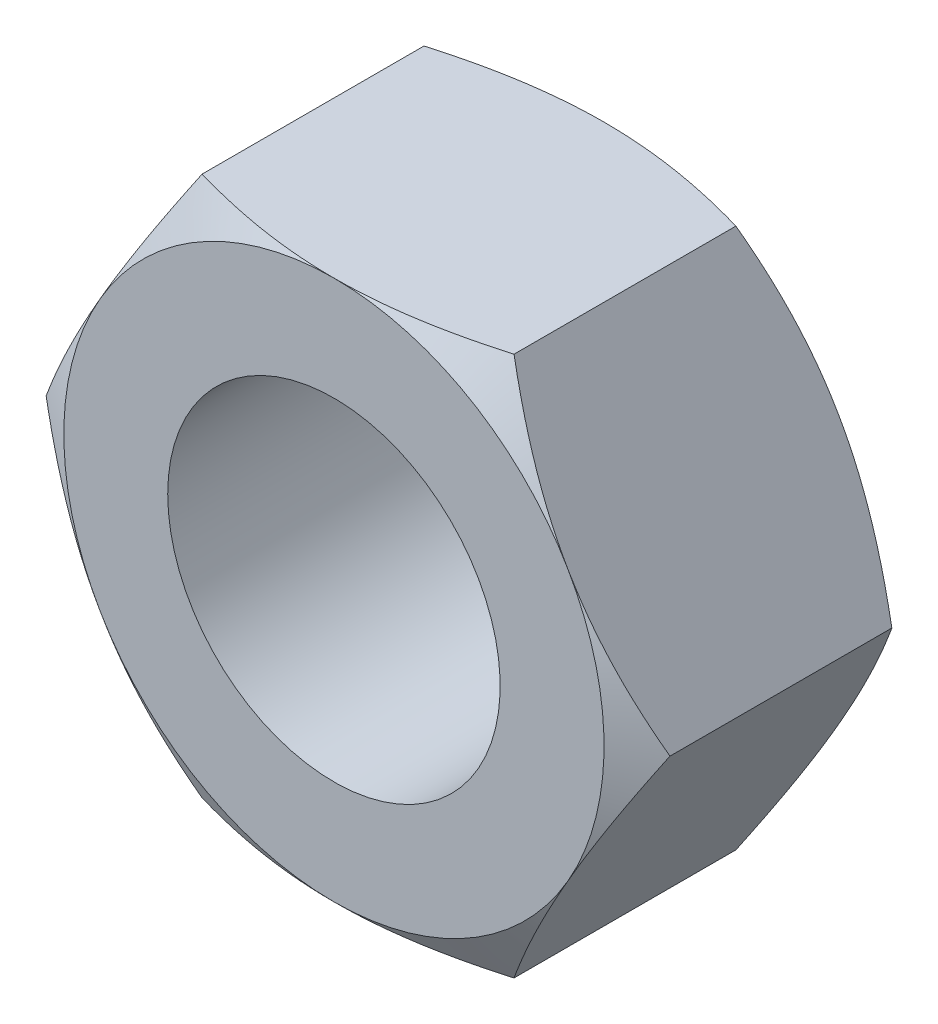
ISO-10303-21;
HEADER;
FILE_DESCRIPTION(('STEP AP214'),'2;1');
FILE_NAME('part.step','',(''),(''),'','','');
FILE_SCHEMA(('AUTOMOTIVE_DESIGN { 1 0 10303 214 1 1 1 1 }'));
ENDSEC;
DATA;
#1=APPLICATION_CONTEXT('core data for automotive mechanical design processes');
#2=APPLICATION_PROTOCOL_DEFINITION('international standard','automotive_design',2000,#1);
#3=PRODUCT_CONTEXT('',#1,'mechanical');
#4=PRODUCT('Part','Part','',(#3));
#5=PRODUCT_RELATED_PRODUCT_CATEGORY('part','',(#4));
#6=PRODUCT_DEFINITION_FORMATION('','',#4);
#7=PRODUCT_DEFINITION_CONTEXT('part definition',#1,'design');
#8=PRODUCT_DEFINITION('design','',#6,#7);
#9=PRODUCT_DEFINITION_SHAPE('','',#8);
#10=(LENGTH_UNIT() NAMED_UNIT(*) SI_UNIT(.MILLI.,.METRE.));
#11=(NAMED_UNIT(*) PLANE_ANGLE_UNIT() SI_UNIT($,.RADIAN.));
#12=(NAMED_UNIT(*) SI_UNIT($,.STERADIAN.) SOLID_ANGLE_UNIT());
#13=UNCERTAINTY_MEASURE_WITH_UNIT(LENGTH_MEASURE(1.E-05),#10,'distance_accuracy_value','');
#14=(GEOMETRIC_REPRESENTATION_CONTEXT(3) GLOBAL_UNCERTAINTY_ASSIGNED_CONTEXT((#13)) GLOBAL_UNIT_ASSIGNED_CONTEXT((#10,
#11,#12)) REPRESENTATION_CONTEXT('',''));
#15=CARTESIAN_POINT('',(0.,0.,0.));
#16=DIRECTION('',(0.,0.,1.));
#17=DIRECTION('',(1.,0.,0.));
#18=AXIS2_PLACEMENT_3D('',#15,#16,#17);
#19=CARTESIAN_POINT('',(-7.5055534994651,0.,3.25));
#20=DIRECTION('',(-0.866025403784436,0.500000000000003,0.));
#21=DIRECTION('',(-0.500000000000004,-0.866025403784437,0.));
#22=AXIS2_PLACEMENT_3D('',#19,#20,#21);
#23=PLANE('',#22);
#24=DIRECTION('',(0.,0.,-1.));
#25=VECTOR('',#24,1.);
#26=CARTESIAN_POINT('',(-7.5055534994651,0.,3.25));
#27=LINE('',#26,#25);
#28=CARTESIAN_POINT('',(-7.50555349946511,0.,2.66944341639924));
#29=VERTEX_POINT('',#28);
#30=CARTESIAN_POINT('',(-7.50555349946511,0.,-2.66944341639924));
#31=VERTEX_POINT('',#30);
#32=EDGE_CURVE('E137',#29,#31,#27,.T.);
#33=ORIENTED_EDGE('',*,*,#32,.F.);
#34=CARTESIAN_POINT('',(-7.50566896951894,-0.00019999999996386,2.66937674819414));
#35=CARTESIAN_POINT('',(-7.42317863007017,0.142677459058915,2.71699557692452));
#36=CARTESIAN_POINT('',(-7.34038072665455,0.286087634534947,2.7624532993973));
#37=CARTESIAN_POINT('',(-7.17411251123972,0.574072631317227,2.84845131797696));
#38=CARTESIAN_POINT('',(-7.09064192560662,0.718647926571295,2.88898949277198));
#39=CARTESIAN_POINT('',(-6.83889369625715,1.15468865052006,3.00242899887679));
#40=CARTESIAN_POINT('',(-6.66962231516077,1.44787528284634,3.06695219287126));
#41=CARTESIAN_POINT('',(-6.41631077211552,1.8866237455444,3.14261341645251));
#42=CARTESIAN_POINT('',(-6.33302748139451,2.03087463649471,3.16416714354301));
#43=CARTESIAN_POINT('',(-6.1660845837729,2.32002821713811,3.20030968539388));
#44=CARTESIAN_POINT('',(-6.0824250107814,2.46493084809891,3.21489911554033));
#45=CARTESIAN_POINT('',(-5.91496056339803,2.75498777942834,3.23674124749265));
#46=CARTESIAN_POINT('',(-5.83115596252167,2.90014160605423,3.24400227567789));
#47=CARTESIAN_POINT('',(-5.66347396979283,3.19057533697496,3.25103969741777));
#48=CARTESIAN_POINT('',(-5.57959658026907,3.33585523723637,3.25081632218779));
#49=CARTESIAN_POINT('',(-5.3497992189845,3.7338759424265,3.23991654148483));
#50=CARTESIAN_POINT('',(-5.20395446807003,3.98648646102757,3.22161818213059));
#51=CARTESIAN_POINT('',(-4.91323365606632,4.49002967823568,3.16359365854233));
#52=CARTESIAN_POINT('',(-4.76835861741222,4.74096060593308,3.12384766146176));
#53=CARTESIAN_POINT('',(-4.47705272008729,5.24551722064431,3.02449409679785));
#54=CARTESIAN_POINT('',(-4.330658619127,5.4990792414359,2.96446557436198));
#55=CARTESIAN_POINT('',(-4.04005357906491,6.00242193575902,2.82822500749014));
#56=CARTESIAN_POINT('',(-3.89583891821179,6.25220905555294,2.75204496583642));
#57=CARTESIAN_POINT('',(-3.7526612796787,6.50019999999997,2.66937674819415));
#58=B_SPLINE_CURVE_WITH_KNOTS('',3,(#34,#35,#36,#37,#38,#39,#40,#41,#42,#43,#44,#45,#46,#47,#48,
#49,#50,#51,#52,#53,#54,#55,#56,#57),.UNSPECIFIED.,.F.,.F.,(4,2,2,2,2,2,2,2,2,2,2,4),(0.,
0.515105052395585,1.03043143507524,2.06322554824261,2.56697389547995,3.07067772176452,
3.57380860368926,4.07692394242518,4.95279354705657,5.82947446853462,6.72559912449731,
7.6199645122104),.UNSPECIFIED.);
#59=CARTESIAN_POINT('',(-5.62916512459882,3.25000000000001,3.25));
#60=VERTEX_POINT('',#59);
#61=EDGE_CURVE('E121',#29,#60,#58,.T.);
#62=ORIENTED_EDGE('',*,*,#61,.T.);
#63=CARTESIAN_POINT('',(-3.75277674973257,6.49999999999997,2.66944341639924));
#64=VERTEX_POINT('',#63);
#65=EDGE_CURVE('E130',#60,#64,#58,.T.);
#66=ORIENTED_EDGE('',*,*,#65,.T.);
#67=DIRECTION('',(0.,0.,-1.));
#68=VECTOR('',#67,1.);
#69=CARTESIAN_POINT('',(-3.75277674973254,6.49999999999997,3.25));
#70=LINE('',#69,#68);
#71=CARTESIAN_POINT('',(-3.75277674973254,6.49999999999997,-2.66944341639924));
#72=VERTEX_POINT('',#71);
#73=EDGE_CURVE('E163',#64,#72,#70,.T.);
#74=ORIENTED_EDGE('',*,*,#73,.T.);
#75=CARTESIAN_POINT('',(-3.7526612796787,6.50019999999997,-2.66937674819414));
#76=CARTESIAN_POINT('',(-3.83515161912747,6.35732254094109,-2.71699557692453));
#77=CARTESIAN_POINT('',(-3.91794952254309,6.21391236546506,-2.7624532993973));
#78=CARTESIAN_POINT('',(-4.08421773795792,5.92592736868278,-2.84845131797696));
#79=CARTESIAN_POINT('',(-4.16768832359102,5.78135207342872,-2.88898949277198));
#80=CARTESIAN_POINT('',(-4.41943655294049,5.34531134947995,-3.0024289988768));
#81=CARTESIAN_POINT('',(-4.58870793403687,5.05212471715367,-3.06695219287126));
#82=CARTESIAN_POINT('',(-4.84201947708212,4.61337625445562,-3.14261341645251));
#83=CARTESIAN_POINT('',(-4.92530276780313,4.4691253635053,-3.16416714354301));
#84=CARTESIAN_POINT('',(-5.09224566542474,4.1799717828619,-3.20030968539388));
#85=CARTESIAN_POINT('',(-5.17590523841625,4.0350691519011,-3.21489911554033));
#86=CARTESIAN_POINT('',(-5.34336968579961,3.74501222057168,-3.23674124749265));
#87=CARTESIAN_POINT('',(-5.42717428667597,3.59985839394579,-3.24400227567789));
#88=CARTESIAN_POINT('',(-5.59485627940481,3.30942466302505,-3.25103969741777));
#89=CARTESIAN_POINT('',(-5.67873366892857,3.16414476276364,-3.25081632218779));
#90=CARTESIAN_POINT('',(-5.90853103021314,2.76612405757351,-3.23991654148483));
#91=CARTESIAN_POINT('',(-6.05437578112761,2.51351353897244,-3.22161818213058));
#92=CARTESIAN_POINT('',(-6.34509659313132,2.00997032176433,-3.16359365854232));
#93=CARTESIAN_POINT('',(-6.48997163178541,1.75903939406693,-3.12384766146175));
#94=CARTESIAN_POINT('',(-6.78127752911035,1.2544827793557,-3.02449409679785));
#95=CARTESIAN_POINT('',(-6.92767163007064,1.00092075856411,-2.96446557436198));
#96=CARTESIAN_POINT('',(-7.21827667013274,0.497578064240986,-2.82822500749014));
#97=CARTESIAN_POINT('',(-7.36249133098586,0.247790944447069,-2.75204496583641));
#98=CARTESIAN_POINT('',(-7.50566896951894,-0.000199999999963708,-2.66937674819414));
#99=B_SPLINE_CURVE_WITH_KNOTS('',3,(#75,#76,#77,#78,#79,#80,#81,#82,#83,#84,#85,#86,#87,#88,#89,
#90,#91,#92,#93,#94,#95,#96,#97,#98),.UNSPECIFIED.,.F.,.F.,(4,2,2,2,2,2,2,2,2,2,2,4),(0.,
0.515105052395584,1.03043143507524,2.06322554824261,2.56697389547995,3.07067772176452,
3.57380860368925,4.07692394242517,4.95279354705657,5.82947446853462,6.72559912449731,
7.6199645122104),.UNSPECIFIED.);
#100=CARTESIAN_POINT('',(-5.62916512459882,3.25000000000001,-3.25));
#101=VERTEX_POINT('',#100);
#102=EDGE_CURVE('E171',#72,#101,#99,.T.);
#103=ORIENTED_EDGE('',*,*,#102,.T.);
#104=EDGE_CURVE('E145',#101,#31,#99,.T.);
#105=ORIENTED_EDGE('',*,*,#104,.T.);
#106=EDGE_LOOP('',(#33,#62,#66,#74,#103,#105));
#107=FACE_BOUND('',#106,.T.);
#108=ADVANCED_FACE('F30',(#107),#23,.T.);
#109=CARTESIAN_POINT('',(-3.75277674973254,-6.49999999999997,3.25));
#110=DIRECTION('',(-0.866025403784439,-0.499999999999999,0.));
#111=DIRECTION('',(0.499999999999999,-0.866025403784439,0.));
#112=AXIS2_PLACEMENT_3D('',#109,#110,#111);
#113=PLANE('',#112);
#114=DIRECTION('',(0.,0.,-1.));
#115=VECTOR('',#114,1.);
#116=CARTESIAN_POINT('',(-3.75277674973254,-6.49999999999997,3.25));
#117=LINE('',#116,#115);
#118=CARTESIAN_POINT('',(-3.75277674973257,-6.49999999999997,2.66944341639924));
#119=VERTEX_POINT('',#118);
#120=CARTESIAN_POINT('',(-3.75277674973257,-6.49999999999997,-2.66944341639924));
#121=VERTEX_POINT('',#120);
#122=EDGE_CURVE('E147',#119,#121,#117,.T.);
#123=ORIENTED_EDGE('',*,*,#122,.F.);
#124=CARTESIAN_POINT('',(-3.75266127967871,-6.50019999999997,2.66937674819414));
#125=CARTESIAN_POINT('',(-3.83515161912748,-6.3573225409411,2.71699557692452));
#126=CARTESIAN_POINT('',(-3.9179495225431,-6.21391236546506,2.7624532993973));
#127=CARTESIAN_POINT('',(-4.08421773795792,-5.92592736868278,2.84845131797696));
#128=CARTESIAN_POINT('',(-4.16768832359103,-5.78135207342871,2.88898949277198));
#129=CARTESIAN_POINT('',(-4.41943655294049,-5.34531134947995,3.0024289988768));
#130=CARTESIAN_POINT('',(-4.58870793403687,-5.05212471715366,3.06695219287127));
#131=CARTESIAN_POINT('',(-4.84201947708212,-4.61337625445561,3.14261341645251));
#132=CARTESIAN_POINT('',(-4.92530276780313,-4.46912536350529,3.16416714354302));
#133=CARTESIAN_POINT('',(-5.09224566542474,-4.1799717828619,3.20030968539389));
#134=CARTESIAN_POINT('',(-5.17590523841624,-4.0350691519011,3.21489911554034));
#135=CARTESIAN_POINT('',(-5.3433696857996,-3.74501222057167,3.23674124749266));
#136=CARTESIAN_POINT('',(-5.42717428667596,-3.59985839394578,3.2440022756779));
#137=CARTESIAN_POINT('',(-5.5948562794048,-3.30942466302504,3.25103969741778));
#138=CARTESIAN_POINT('',(-5.67873366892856,-3.16414476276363,3.2508163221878));
#139=CARTESIAN_POINT('',(-5.90853103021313,-2.76612405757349,3.23991654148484));
#140=CARTESIAN_POINT('',(-6.05437578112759,-2.51351353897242,3.2216181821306));
#141=CARTESIAN_POINT('',(-6.34509659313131,-2.0099703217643,3.16359365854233));
#142=CARTESIAN_POINT('',(-6.48997163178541,-1.7590393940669,3.12384766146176));
#143=CARTESIAN_POINT('',(-6.78127752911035,-1.25448277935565,3.02449409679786));
#144=CARTESIAN_POINT('',(-6.92767163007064,-1.00092075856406,2.96446557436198));
#145=CARTESIAN_POINT('',(-7.21827667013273,-0.497578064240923,2.82822500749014));
#146=CARTESIAN_POINT('',(-7.36249133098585,-0.247790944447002,2.75204496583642));
#147=CARTESIAN_POINT('',(-7.50566896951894,0.000200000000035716,2.66937674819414));
#148=B_SPLINE_CURVE_WITH_KNOTS('',3,(#124,#125,#126,#127,#128,#129,#130,#131,#132,#133,#134,
#135,#136,#137,#138,#139,#140,#141,#142,#143,#144,#145,#146,#147),.UNSPECIFIED.,.F.,.F.,(4,2,2,
2,2,2,2,2,2,2,2,4),(0.,0.515105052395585,1.03043143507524,2.06322554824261,2.56697389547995,
3.07067772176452,3.57380860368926,4.07692394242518,4.95279354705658,5.82947446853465,
6.72559912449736,7.61996451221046),.UNSPECIFIED.);
#149=CARTESIAN_POINT('',(-5.62916512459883,-3.24999999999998,3.25));
#150=VERTEX_POINT('',#149);
#151=EDGE_CURVE('E139',#119,#150,#148,.T.);
#152=ORIENTED_EDGE('',*,*,#151,.T.);
#153=EDGE_CURVE('E124',#150,#29,#148,.T.);
#154=ORIENTED_EDGE('',*,*,#153,.T.);
#155=ORIENTED_EDGE('',*,*,#32,.T.);
#156=CARTESIAN_POINT('',(-7.50566896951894,0.000200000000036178,-2.66937674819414));
#157=CARTESIAN_POINT('',(-7.42317863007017,-0.142677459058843,-2.71699557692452));
#158=CARTESIAN_POINT('',(-7.34038072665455,-0.286087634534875,-2.7624532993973));
#159=CARTESIAN_POINT('',(-7.17411251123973,-0.574072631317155,-2.84845131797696));
#160=CARTESIAN_POINT('',(-7.09064192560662,-0.718647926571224,-2.88898949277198));
#161=CARTESIAN_POINT('',(-6.83889369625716,-1.15468865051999,-3.0024289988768));
#162=CARTESIAN_POINT('',(-6.66962231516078,-1.44787528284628,-3.06695219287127));
#163=CARTESIAN_POINT('',(-6.41631077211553,-1.88662374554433,-3.14261341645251));
#164=CARTESIAN_POINT('',(-6.33302748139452,-2.03087463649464,-3.16416714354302));
#165=CARTESIAN_POINT('',(-6.16608458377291,-2.32002821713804,-3.20030968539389));
#166=CARTESIAN_POINT('',(-6.08242501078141,-2.46493084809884,-3.21489911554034));
#167=CARTESIAN_POINT('',(-5.91496056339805,-2.75498777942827,-3.23674124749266));
#168=CARTESIAN_POINT('',(-5.83115596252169,-2.90014160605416,-3.2440022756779));
#169=CARTESIAN_POINT('',(-5.66347396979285,-3.1905753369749,-3.25103969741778));
#170=CARTESIAN_POINT('',(-5.57959658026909,-3.33585523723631,-3.2508163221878));
#171=CARTESIAN_POINT('',(-5.34979921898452,-3.73387594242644,-3.23991654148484));
#172=CARTESIAN_POINT('',(-5.20395446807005,-3.98648646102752,-3.22161818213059));
#173=CARTESIAN_POINT('',(-4.91323365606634,-4.49002967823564,-3.16359365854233));
#174=CARTESIAN_POINT('',(-4.76835861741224,-4.74096060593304,-3.12384766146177));
#175=CARTESIAN_POINT('',(-4.4770527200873,-5.24551722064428,-3.02449409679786));
#176=CARTESIAN_POINT('',(-4.33065861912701,-5.49907924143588,-2.96446557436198));
#177=CARTESIAN_POINT('',(-4.04005357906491,-6.00242193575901,-2.82822500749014));
#178=CARTESIAN_POINT('',(-3.89583891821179,-6.25220905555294,-2.75204496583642));
#179=CARTESIAN_POINT('',(-3.75266127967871,-6.50019999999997,-2.66937674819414));
#180=B_SPLINE_CURVE_WITH_KNOTS('',3,(#156,#157,#158,#159,#160,#161,#162,#163,#164,#165,#166,
#167,#168,#169,#170,#171,#172,#173,#174,#175,#176,#177,#178,#179),.UNSPECIFIED.,.F.,.F.,(4,2,2,
2,2,2,2,2,2,2,2,4),(0.,0.515105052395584,1.03043143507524,2.06322554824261,2.56697389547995,
3.07067772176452,3.57380860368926,4.07692394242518,4.95279354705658,5.82947446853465,
6.72559912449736,7.61996451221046),.UNSPECIFIED.);
#181=CARTESIAN_POINT('',(-5.62916512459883,-3.24999999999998,-3.25));
#182=VERTEX_POINT('',#181);
#183=EDGE_CURVE('E180',#31,#182,#180,.T.);
#184=ORIENTED_EDGE('',*,*,#183,.T.);
#185=EDGE_CURVE('E181',#182,#121,#180,.T.);
#186=ORIENTED_EDGE('',*,*,#185,.T.);
#187=EDGE_LOOP('',(#123,#152,#154,#155,#184,#186));
#188=FACE_BOUND('',#187,.T.);
#189=ADVANCED_FACE('F135',(#188),#113,.T.);
#190=CARTESIAN_POINT('',(3.75277674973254,-6.49999999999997,3.25));
#191=DIRECTION('',(0.,-1.,0.));
#192=DIRECTION('',(1.,0.,0.));
#193=AXIS2_PLACEMENT_3D('',#190,#191,#192);
#194=PLANE('',#193);
#195=DIRECTION('',(0.,0.,-1.));
#196=VECTOR('',#195,1.);
#197=CARTESIAN_POINT('',(3.75277674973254,-6.49999999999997,3.25));
#198=LINE('',#197,#196);
#199=CARTESIAN_POINT('',(3.75277674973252,-6.5,2.66944341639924));
#200=VERTEX_POINT('',#199);
#201=CARTESIAN_POINT('',(3.75277674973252,-6.5,-2.66944341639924));
#202=VERTEX_POINT('',#201);
#203=EDGE_CURVE('E152',#200,#202,#198,.T.);
#204=ORIENTED_EDGE('',*,*,#203,.F.);
#205=CARTESIAN_POINT('',(-9.95291930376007,-6.49999999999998,0.139575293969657));
#206=CARTESIAN_POINT('',(-9.66753246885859,-6.49999999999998,0.277489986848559));
#207=CARTESIAN_POINT('',(-9.38147088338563,-6.49999999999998,0.414033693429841));
#208=CARTESIAN_POINT('',(-8.80763337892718,-6.49999999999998,0.683595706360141));
#209=CARTESIAN_POINT('',(-8.51985717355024,-6.49999999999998,0.81661340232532));
#210=CARTESIAN_POINT('',(-7.94067105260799,-6.49999999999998,1.07904071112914));
#211=CARTESIAN_POINT('',(-7.64924976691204,-6.49999999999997,1.20842532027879));
#212=CARTESIAN_POINT('',(-7.06401195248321,-6.49999999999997,1.46163715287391));
#213=CARTESIAN_POINT('',(-6.77019554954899,-6.49999999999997,1.58546466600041));
#214=CARTESIAN_POINT('',(-6.17605277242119,-6.49999999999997,1.82755469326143));
#215=CARTESIAN_POINT('',(-5.87569076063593,-6.49999999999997,1.94573022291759));
#216=CARTESIAN_POINT('',(-5.2714237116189,-6.49999999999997,2.17282573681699));
#217=CARTESIAN_POINT('',(-4.96751828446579,-6.49999999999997,2.28174469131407));
#218=CARTESIAN_POINT('',(-4.35630617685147,-6.49999999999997,2.48740073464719));
#219=CARTESIAN_POINT('',(-4.04900829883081,-6.49999999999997,2.58416372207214));
#220=CARTESIAN_POINT('',(-3.43004071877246,-6.49999999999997,2.76236415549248));
#221=CARTESIAN_POINT('',(-3.11837243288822,-6.49999999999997,2.84380644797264));
#222=CARTESIAN_POINT('',(-2.49046612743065,-6.49999999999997,2.98741588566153));
#223=CARTESIAN_POINT('',(-2.17422691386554,-6.49999999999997,3.04957789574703));
#224=CARTESIAN_POINT('',(-1.537891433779,-6.49999999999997,3.15042581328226));
#225=CARTESIAN_POINT('',(-1.21779516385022,-6.49999999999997,3.18911169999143));
#226=CARTESIAN_POINT('',(-0.737141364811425,-6.49999999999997,3.22705347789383));
#227=CARTESIAN_POINT('',(-0.577336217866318,-6.49999999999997,3.23635482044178));
#228=CARTESIAN_POINT('',(-0.257468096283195,-6.49999999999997,3.24818593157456));
#229=CARTESIAN_POINT('',(-0.097405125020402,-6.49999999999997,3.25071578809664));
#230=CARTESIAN_POINT('',(0.22263646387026,-6.49999999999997,3.24893596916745));
#231=CARTESIAN_POINT('',(0.382615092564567,-6.49999999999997,3.24462821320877));
#232=CARTESIAN_POINT('',(0.702251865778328,-6.49999999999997,3.22928234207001));
#233=CARTESIAN_POINT('',(0.861909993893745,-6.49999999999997,3.21824389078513));
#234=CARTESIAN_POINT('',(1.24887194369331,-6.49999999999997,3.18356297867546));
#235=CARTESIAN_POINT('',(1.47587839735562,-6.49999999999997,3.15654793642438));
#236=CARTESIAN_POINT('',(1.92815183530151,-6.49999999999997,3.09040986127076));
#237=CARTESIAN_POINT('',(2.1534183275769,-6.49999999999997,3.05128352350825));
#238=CARTESIAN_POINT('',(2.60202592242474,-6.49999999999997,2.96231047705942));
#239=CARTESIAN_POINT('',(2.82536499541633,-6.49999999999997,2.91245363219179));
#240=CARTESIAN_POINT('',(3.26974530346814,-6.49999999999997,2.80354078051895));
#241=CARTESIAN_POINT('',(3.49078675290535,-6.49999999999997,2.74448564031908));
#242=CARTESIAN_POINT('',(3.93601601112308,-6.49999999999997,2.61704532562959));
#243=CARTESIAN_POINT('',(4.16014813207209,-6.49999999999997,2.54846693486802));
#244=CARTESIAN_POINT('',(4.60604329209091,-6.49999999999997,2.40453421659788));
#245=CARTESIAN_POINT('',(4.82780784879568,-6.49999999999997,2.3291845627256));
#246=CARTESIAN_POINT('',(5.26807801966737,-6.49999999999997,2.17326573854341));
#247=CARTESIAN_POINT('',(5.48659495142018,-6.49999999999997,2.09272833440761));
#248=CARTESIAN_POINT('',(5.92193342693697,-6.49999999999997,1.92692644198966));
#249=CARTESIAN_POINT('',(6.13875424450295,-6.49999999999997,1.84166004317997));
#250=CARTESIAN_POINT('',(6.3547873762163,-6.49999999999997,1.75449694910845));
#251=B_SPLINE_CURVE_WITH_KNOTS('',3,(#205,#206,#207,#208,#209,#210,#211,#212,#213,#214,#215,
#216,#217,#218,#219,#220,#221,#222,#223,#224,#225,#226,#227,#228,#229,#230,#231,#232,#233,#234,
#235,#236,#237,#238,#239,#240,#241,#242,#243,#244,#245,#246,#247,#248,#249,#250),.UNSPECIFIED.,
.F.,.F.,(4,2,2,2,2,2,2,2,2,2,2,2,2,2,2,2,2,2,2,2,2,2,4),(0.,0.950904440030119,1.90197242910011,
2.85848299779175,3.81494364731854,4.78314666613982,5.75145725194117,6.71766851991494,
7.68357362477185,8.64973576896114,9.61589876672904,10.0960037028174,10.5761024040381,
11.0560663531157,11.5360542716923,12.2214972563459,12.9071274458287,13.5934081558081,
14.2796242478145,14.9826609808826,15.6852161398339,16.3838168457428,17.0827018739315),.UNSPECIFIED.);
#252=CARTESIAN_POINT('',(0.,-6.49999999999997,3.25));
#253=VERTEX_POINT('',#252);
#254=EDGE_CURVE('E245',#200,#253,#251,.F.);
#255=ORIENTED_EDGE('',*,*,#254,.T.);
#256=EDGE_CURVE('E240',#253,#119,#251,.F.);
#257=ORIENTED_EDGE('',*,*,#256,.T.);
#258=ORIENTED_EDGE('',*,*,#122,.T.);
#259=CARTESIAN_POINT('',(-9.95291930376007,-6.49999999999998,-0.139575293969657));
#260=CARTESIAN_POINT('',(-9.66753246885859,-6.49999999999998,-0.277489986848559));
#261=CARTESIAN_POINT('',(-9.38147088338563,-6.49999999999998,-0.414033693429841));
#262=CARTESIAN_POINT('',(-8.80763337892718,-6.49999999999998,-0.683595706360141));
#263=CARTESIAN_POINT('',(-8.51985717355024,-6.49999999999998,-0.81661340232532));
#264=CARTESIAN_POINT('',(-7.94067105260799,-6.49999999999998,-1.07904071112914));
#265=CARTESIAN_POINT('',(-7.64924976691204,-6.49999999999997,-1.20842532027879));
#266=CARTESIAN_POINT('',(-7.06401195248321,-6.49999999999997,-1.46163715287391));
#267=CARTESIAN_POINT('',(-6.77019554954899,-6.49999999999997,-1.58546466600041));
#268=CARTESIAN_POINT('',(-6.17605277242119,-6.49999999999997,-1.82755469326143));
#269=CARTESIAN_POINT('',(-5.87569076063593,-6.49999999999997,-1.94573022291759));
#270=CARTESIAN_POINT('',(-5.2714237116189,-6.49999999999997,-2.17282573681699));
#271=CARTESIAN_POINT('',(-4.96751828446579,-6.49999999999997,-2.28174469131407));
#272=CARTESIAN_POINT('',(-4.35630617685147,-6.49999999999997,-2.48740073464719));
#273=CARTESIAN_POINT('',(-4.04900829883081,-6.49999999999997,-2.58416372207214));
#274=CARTESIAN_POINT('',(-3.43004071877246,-6.49999999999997,-2.76236415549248));
#275=CARTESIAN_POINT('',(-3.11837243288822,-6.49999999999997,-2.84380644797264));
#276=CARTESIAN_POINT('',(-2.49046612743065,-6.49999999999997,-2.98741588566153));
#277=CARTESIAN_POINT('',(-2.17422691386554,-6.49999999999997,-3.04957789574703));
#278=CARTESIAN_POINT('',(-1.537891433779,-6.49999999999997,-3.15042581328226));
#279=CARTESIAN_POINT('',(-1.21779516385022,-6.49999999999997,-3.18911169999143));
#280=CARTESIAN_POINT('',(-0.737141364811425,-6.49999999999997,-3.22705347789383));
#281=CARTESIAN_POINT('',(-0.577336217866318,-6.49999999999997,-3.23635482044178));
#282=CARTESIAN_POINT('',(-0.257468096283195,-6.49999999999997,-3.24818593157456));
#283=CARTESIAN_POINT('',(-0.097405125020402,-6.49999999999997,-3.25071578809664));
#284=CARTESIAN_POINT('',(0.22263646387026,-6.49999999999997,-3.24893596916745));
#285=CARTESIAN_POINT('',(0.382615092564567,-6.49999999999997,-3.24462821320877));
#286=CARTESIAN_POINT('',(0.702251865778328,-6.49999999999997,-3.22928234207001));
#287=CARTESIAN_POINT('',(0.861909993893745,-6.49999999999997,-3.21824389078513));
#288=CARTESIAN_POINT('',(1.24887194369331,-6.49999999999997,-3.18356297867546));
#289=CARTESIAN_POINT('',(1.47587839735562,-6.49999999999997,-3.15654793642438));
#290=CARTESIAN_POINT('',(1.92815183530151,-6.49999999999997,-3.09040986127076));
#291=CARTESIAN_POINT('',(2.1534183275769,-6.49999999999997,-3.05128352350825));
#292=CARTESIAN_POINT('',(2.60202592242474,-6.49999999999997,-2.96231047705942));
#293=CARTESIAN_POINT('',(2.82536499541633,-6.49999999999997,-2.91245363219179));
#294=CARTESIAN_POINT('',(3.26974530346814,-6.49999999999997,-2.80354078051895));
#295=CARTESIAN_POINT('',(3.49078675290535,-6.49999999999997,-2.74448564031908));
#296=CARTESIAN_POINT('',(3.93601601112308,-6.49999999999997,-2.61704532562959));
#297=CARTESIAN_POINT('',(4.16014813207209,-6.49999999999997,-2.54846693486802));
#298=CARTESIAN_POINT('',(4.60604329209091,-6.49999999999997,-2.40453421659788));
#299=CARTESIAN_POINT('',(4.82780784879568,-6.49999999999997,-2.3291845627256));
#300=CARTESIAN_POINT('',(5.26807801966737,-6.49999999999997,-2.17326573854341));
#301=CARTESIAN_POINT('',(5.48659495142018,-6.49999999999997,-2.09272833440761));
#302=CARTESIAN_POINT('',(5.92193342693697,-6.49999999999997,-1.92692644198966));
#303=CARTESIAN_POINT('',(6.13875424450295,-6.49999999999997,-1.84166004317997));
#304=CARTESIAN_POINT('',(6.3547873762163,-6.49999999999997,-1.75449694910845));
#305=B_SPLINE_CURVE_WITH_KNOTS('',3,(#259,#260,#261,#262,#263,#264,#265,#266,#267,#268,#269,
#270,#271,#272,#273,#274,#275,#276,#277,#278,#279,#280,#281,#282,#283,#284,#285,#286,#287,#288,
#289,#290,#291,#292,#293,#294,#295,#296,#297,#298,#299,#300,#301,#302,#303,#304),.UNSPECIFIED.,
.F.,.F.,(4,2,2,2,2,2,2,2,2,2,2,2,2,2,2,2,2,2,2,2,2,2,4),(0.,0.950904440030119,1.90197242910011,
2.85848299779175,3.81494364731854,4.78314666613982,5.75145725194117,6.71766851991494,
7.68357362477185,8.64973576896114,9.61589876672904,10.0960037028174,10.5761024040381,
11.0560663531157,11.5360542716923,12.2214972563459,12.9071274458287,13.5934081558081,
14.2796242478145,14.9826609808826,15.6852161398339,16.3838168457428,17.0827018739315),.UNSPECIFIED.);
#306=CARTESIAN_POINT('',(0.,-6.49999999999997,-3.25));
#307=VERTEX_POINT('',#306);
#308=EDGE_CURVE('E228',#121,#307,#305,.T.);
#309=ORIENTED_EDGE('',*,*,#308,.T.);
#310=EDGE_CURVE('E222',#307,#202,#305,.T.);
#311=ORIENTED_EDGE('',*,*,#310,.T.);
#312=EDGE_LOOP('',(#204,#255,#257,#258,#309,#311));
#313=FACE_BOUND('',#312,.T.);
#314=ADVANCED_FACE('F230',(#313),#194,.T.);
#315=CARTESIAN_POINT('',(7.50555349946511,0.,3.25));
#316=DIRECTION('',(0.866025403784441,-0.499999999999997,0.));
#317=DIRECTION('',(0.499999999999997,0.866025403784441,0.));
#318=AXIS2_PLACEMENT_3D('',#315,#316,#317);
#319=PLANE('',#318);
#320=DIRECTION('',(0.,0.,-1.));
#321=VECTOR('',#320,1.);
#322=CARTESIAN_POINT('',(7.50555349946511,0.,3.25));
#323=LINE('',#322,#321);
#324=CARTESIAN_POINT('',(7.50555349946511,0.,2.66944341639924));
#325=VERTEX_POINT('',#324);
#326=CARTESIAN_POINT('',(7.50555349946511,0.,-2.66944341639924));
#327=VERTEX_POINT('',#326);
#328=EDGE_CURVE('E159',#325,#327,#323,.T.);
#329=ORIENTED_EDGE('',*,*,#328,.F.);
#330=CARTESIAN_POINT('',(7.50566896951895,0.000200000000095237,2.66937674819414));
#331=CARTESIAN_POINT('',(7.42317863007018,-0.142677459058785,2.71699557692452));
#332=CARTESIAN_POINT('',(7.34038072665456,-0.286087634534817,2.7624532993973));
#333=CARTESIAN_POINT('',(7.17411251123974,-0.574072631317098,2.84845131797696));
#334=CARTESIAN_POINT('',(7.09064192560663,-0.718647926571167,2.88898949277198));
#335=CARTESIAN_POINT('',(6.83889369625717,-1.15468865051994,3.0024289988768));
#336=CARTESIAN_POINT('',(6.66962231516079,-1.44787528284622,3.06695219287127));
#337=CARTESIAN_POINT('',(6.41631077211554,-1.88662374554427,3.14261341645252));
#338=CARTESIAN_POINT('',(6.33302748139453,-2.03087463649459,3.16416714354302));
#339=CARTESIAN_POINT('',(6.16608458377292,-2.32002821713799,3.20030968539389));
#340=CARTESIAN_POINT('',(6.08242501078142,-2.46493084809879,3.21489911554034));
#341=CARTESIAN_POINT('',(5.91496056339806,-2.75498777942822,3.23674124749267));
#342=CARTESIAN_POINT('',(5.8311559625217,-2.90014160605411,3.2440022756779));
#343=CARTESIAN_POINT('',(5.66347396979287,-3.19057533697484,3.25103969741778));
#344=CARTESIAN_POINT('',(5.5795965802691,-3.33585523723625,3.25081632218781));
#345=CARTESIAN_POINT('',(5.34979921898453,-3.73387594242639,3.23991654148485));
#346=CARTESIAN_POINT('',(5.20395446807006,-3.98648646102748,3.22161818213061));
#347=CARTESIAN_POINT('',(4.91323365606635,-4.4900296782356,3.16359365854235));
#348=CARTESIAN_POINT('',(4.76835861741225,-4.74096060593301,3.12384766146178));
#349=CARTESIAN_POINT('',(4.4770527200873,-5.24551722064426,3.02449409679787));
#350=CARTESIAN_POINT('',(4.33065861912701,-5.49907924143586,2.96446557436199));
#351=CARTESIAN_POINT('',(4.04005357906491,-6.00242193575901,2.82822500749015));
#352=CARTESIAN_POINT('',(3.89583891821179,-6.25220905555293,2.75204496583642));
#353=CARTESIAN_POINT('',(3.7526612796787,-6.50019999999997,2.66937674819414));
#354=B_SPLINE_CURVE_WITH_KNOTS('',3,(#330,#331,#332,#333,#334,#335,#336,#337,#338,#339,#340,
#341,#342,#343,#344,#345,#346,#347,#348,#349,#350,#351,#352,#353),.UNSPECIFIED.,.F.,.F.,(4,2,2,
2,2,2,2,2,2,2,2,4),(0.,0.515105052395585,1.03043143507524,2.06322554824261,2.56697389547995,
3.07067772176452,3.57380860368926,4.07692394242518,4.9527935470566,5.82947446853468,
6.72559912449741,7.61996451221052),.UNSPECIFIED.);
#355=CARTESIAN_POINT('',(5.62916512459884,-3.24999999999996,3.25));
#356=VERTEX_POINT('',#355);
#357=EDGE_CURVE('E140',#325,#356,#354,.T.);
#358=ORIENTED_EDGE('',*,*,#357,.T.);
#359=EDGE_CURVE('E246',#356,#200,#354,.T.);
#360=ORIENTED_EDGE('',*,*,#359,.T.);
#361=ORIENTED_EDGE('',*,*,#203,.T.);
#362=CARTESIAN_POINT('',(3.7526612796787,-6.50019999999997,-2.66937674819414));
#363=CARTESIAN_POINT('',(3.83515161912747,-6.35732254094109,-2.71699557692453));
#364=CARTESIAN_POINT('',(3.91794952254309,-6.21391236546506,-2.7624532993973));
#365=CARTESIAN_POINT('',(4.08421773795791,-5.92592736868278,-2.84845131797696));
#366=CARTESIAN_POINT('',(4.16768832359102,-5.78135207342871,-2.88898949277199));
#367=CARTESIAN_POINT('',(4.41943655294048,-5.34531134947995,-3.0024289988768));
#368=CARTESIAN_POINT('',(4.58870793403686,-5.05212471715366,-3.06695219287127));
#369=CARTESIAN_POINT('',(4.84201947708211,-4.61337625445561,-3.14261341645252));
#370=CARTESIAN_POINT('',(4.92530276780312,-4.46912536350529,-3.16416714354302));
#371=CARTESIAN_POINT('',(5.09224566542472,-4.17997178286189,-3.20030968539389));
#372=CARTESIAN_POINT('',(5.17590523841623,-4.0350691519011,-3.21489911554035));
#373=CARTESIAN_POINT('',(5.34336968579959,-3.74501222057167,-3.23674124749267));
#374=CARTESIAN_POINT('',(5.42717428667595,-3.59985839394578,-3.24400227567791));
#375=CARTESIAN_POINT('',(5.59485627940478,-3.30942466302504,-3.25103969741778));
#376=CARTESIAN_POINT('',(5.67873366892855,-3.16414476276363,-3.25081632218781));
#377=CARTESIAN_POINT('',(5.90853103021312,-2.76612405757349,-3.23991654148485));
#378=CARTESIAN_POINT('',(6.05437578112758,-2.5135135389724,-3.2216181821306));
#379=CARTESIAN_POINT('',(6.3450965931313,-2.00997032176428,-3.16359365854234));
#380=CARTESIAN_POINT('',(6.4899716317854,-1.75903939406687,-3.12384766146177));
#381=CARTESIAN_POINT('',(6.78127752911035,-1.25448277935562,-3.02449409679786));
#382=CARTESIAN_POINT('',(6.92767163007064,-1.00092075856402,-2.96446557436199));
#383=CARTESIAN_POINT('',(7.21827667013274,-0.497578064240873,-2.82822500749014));
#384=CARTESIAN_POINT('',(7.36249133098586,-0.247790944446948,-2.75204496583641));
#385=CARTESIAN_POINT('',(7.50566896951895,0.000200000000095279,-2.66937674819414));
#386=B_SPLINE_CURVE_WITH_KNOTS('',3,(#362,#363,#364,#365,#366,#367,#368,#369,#370,#371,#372,
#373,#374,#375,#376,#377,#378,#379,#380,#381,#382,#383,#384,#385),.UNSPECIFIED.,.F.,.F.,(4,2,2,
2,2,2,2,2,2,2,2,4),(0.,0.515105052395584,1.03043143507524,2.06322554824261,2.56697389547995,
3.07067772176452,3.57380860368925,4.07692394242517,4.9527935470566,5.82947446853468,
6.7255991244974,7.61996451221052),.UNSPECIFIED.);
#387=CARTESIAN_POINT('',(5.62916512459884,-3.24999999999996,-3.25));
#388=VERTEX_POINT('',#387);
#389=EDGE_CURVE('E229',#202,#388,#386,.T.);
#390=ORIENTED_EDGE('',*,*,#389,.T.);
#391=EDGE_CURVE('E217',#388,#327,#386,.T.);
#392=ORIENTED_EDGE('',*,*,#391,.T.);
#393=EDGE_LOOP('',(#329,#358,#360,#361,#390,#392));
#394=FACE_BOUND('',#393,.T.);
#395=ADVANCED_FACE('F233',(#394),#319,.T.);
#396=CARTESIAN_POINT('',(3.75277674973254,6.50000000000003,3.25));
#397=DIRECTION('',(0.866025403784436,0.500000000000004,0.));
#398=DIRECTION('',(-0.500000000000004,0.866025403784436,0.));
#399=AXIS2_PLACEMENT_3D('',#396,#397,#398);
#400=PLANE('',#399);
#401=DIRECTION('',(0.,0.,-1.));
#402=VECTOR('',#401,1.);
#403=CARTESIAN_POINT('',(3.75277674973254,6.50000000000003,3.25));
#404=LINE('',#403,#402);
#405=CARTESIAN_POINT('',(3.75277674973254,6.50000000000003,2.66944341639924));
#406=VERTEX_POINT('',#405);
#407=CARTESIAN_POINT('',(3.75277674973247,6.50000000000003,-2.66944341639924));
#408=VERTEX_POINT('',#407);
#409=EDGE_CURVE('E161',#406,#408,#404,.T.);
#410=ORIENTED_EDGE('',*,*,#409,.F.);
#411=CARTESIAN_POINT('',(3.7526612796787,6.50020000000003,2.66937674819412));
#412=CARTESIAN_POINT('',(3.83515161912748,6.35732254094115,2.7169955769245));
#413=CARTESIAN_POINT('',(3.9179495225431,6.21391236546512,2.76245329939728));
#414=CARTESIAN_POINT('',(4.08421773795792,5.92592736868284,2.84845131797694));
#415=CARTESIAN_POINT('',(4.16768832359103,5.78135207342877,2.88898949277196));
#416=CARTESIAN_POINT('',(4.41943655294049,5.34531134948,3.00242899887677));
#417=CARTESIAN_POINT('',(4.58870793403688,5.05212471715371,3.06695219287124));
#418=CARTESIAN_POINT('',(4.84201947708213,4.61337625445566,3.14261341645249));
#419=CARTESIAN_POINT('',(4.92530276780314,4.46912536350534,3.16416714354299));
#420=CARTESIAN_POINT('',(5.09224566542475,4.17997178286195,3.20030968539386));
#421=CARTESIAN_POINT('',(5.17590523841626,4.03506915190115,3.21489911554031));
#422=CARTESIAN_POINT('',(5.34336968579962,3.74501222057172,3.23674124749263));
#423=CARTESIAN_POINT('',(5.42717428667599,3.59985839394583,3.24400227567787));
#424=CARTESIAN_POINT('',(5.59485627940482,3.30942466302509,3.25103969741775));
#425=CARTESIAN_POINT('',(5.67873366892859,3.16414476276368,3.25081632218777));
#426=CARTESIAN_POINT('',(5.90853103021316,2.76612405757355,3.23991654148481));
#427=CARTESIAN_POINT('',(6.05437578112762,2.51351353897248,3.22161818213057));
#428=CARTESIAN_POINT('',(6.34509659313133,2.00997032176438,3.16359365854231));
#429=CARTESIAN_POINT('',(6.48997163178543,1.75903939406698,3.12384766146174));
#430=CARTESIAN_POINT('',(6.78127752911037,1.25448277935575,3.02449409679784));
#431=CARTESIAN_POINT('',(6.92767163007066,1.00092075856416,2.96446557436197));
#432=CARTESIAN_POINT('',(7.21827667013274,0.497578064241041,2.82822500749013));
#433=CARTESIAN_POINT('',(7.36249133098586,0.247790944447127,2.75204496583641));
#434=CARTESIAN_POINT('',(7.50566896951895,-0.000199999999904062,2.66937674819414));
#435=B_SPLINE_CURVE_WITH_KNOTS('',3,(#411,#412,#413,#414,#415,#416,#417,#418,#419,#420,#421,
#422,#423,#424,#425,#426,#427,#428,#429,#430,#431,#432,#433,#434),.UNSPECIFIED.,.F.,.F.,(4,2,2,
2,2,2,2,2,2,2,2,4),(0.,0.515105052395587,1.03043143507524,2.06322554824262,2.56697389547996,
3.07067772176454,3.57380860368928,4.0769239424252,4.95279354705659,5.82947446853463,
6.72559912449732,7.61996451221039),.UNSPECIFIED.);
#436=CARTESIAN_POINT('',(5.62916512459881,3.25000000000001,3.25));
#437=VERTEX_POINT('',#436);
#438=EDGE_CURVE('E276',#406,#437,#435,.T.);
#439=ORIENTED_EDGE('',*,*,#438,.T.);
#440=EDGE_CURVE('E53',#437,#325,#435,.T.);
#441=ORIENTED_EDGE('',*,*,#440,.T.);
#442=ORIENTED_EDGE('',*,*,#328,.T.);
#443=CARTESIAN_POINT('',(7.50566896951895,-0.000199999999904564,-2.66937674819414));
#444=CARTESIAN_POINT('',(7.42317863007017,0.142677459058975,-2.71699557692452));
#445=CARTESIAN_POINT('',(7.34038072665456,0.286087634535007,-2.76245329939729));
#446=CARTESIAN_POINT('',(7.17411251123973,0.574072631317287,-2.84845131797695));
#447=CARTESIAN_POINT('',(7.09064192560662,0.718647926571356,-2.88898949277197));
#448=CARTESIAN_POINT('',(6.83889369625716,1.15468865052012,-3.00242899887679));
#449=CARTESIAN_POINT('',(6.66962231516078,1.44787528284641,-3.06695219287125));
#450=CARTESIAN_POINT('',(6.41631077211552,1.88662374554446,-3.1426134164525));
#451=CARTESIAN_POINT('',(6.33302748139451,2.03087463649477,-3.164167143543));
#452=CARTESIAN_POINT('',(6.1660845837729,2.32002821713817,-3.20030968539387));
#453=CARTESIAN_POINT('',(6.0824250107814,2.46493084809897,-3.21489911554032));
#454=CARTESIAN_POINT('',(5.91496056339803,2.7549877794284,-3.23674124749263));
#455=CARTESIAN_POINT('',(5.83115596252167,2.90014160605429,-3.24400227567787));
#456=CARTESIAN_POINT('',(5.66347396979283,3.19057533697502,-3.25103969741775));
#457=CARTESIAN_POINT('',(5.57959658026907,3.33585523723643,-3.25081632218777));
#458=CARTESIAN_POINT('',(5.3497992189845,3.73387594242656,-3.23991654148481));
#459=CARTESIAN_POINT('',(5.20395446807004,3.98648646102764,-3.22161818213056));
#460=CARTESIAN_POINT('',(4.91323365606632,4.49002967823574,-3.1635936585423));
#461=CARTESIAN_POINT('',(4.76835861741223,4.74096060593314,-3.12384766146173));
#462=CARTESIAN_POINT('',(4.47705272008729,5.24551722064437,-3.02449409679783));
#463=CARTESIAN_POINT('',(4.330658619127,5.49907924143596,-2.96446557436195));
#464=CARTESIAN_POINT('',(4.04005357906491,6.00242193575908,-2.82822500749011));
#465=CARTESIAN_POINT('',(3.89583891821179,6.252209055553,-2.75204496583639));
#466=CARTESIAN_POINT('',(3.7526612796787,6.50020000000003,-2.66937674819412));
#467=B_SPLINE_CURVE_WITH_KNOTS('',3,(#443,#444,#445,#446,#447,#448,#449,#450,#451,#452,#453,
#454,#455,#456,#457,#458,#459,#460,#461,#462,#463,#464,#465,#466),.UNSPECIFIED.,.F.,.F.,(4,2,2,
2,2,2,2,2,2,2,2,4),(0.,0.515105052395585,1.03043143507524,2.06322554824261,2.56697389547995,
3.07067772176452,3.57380860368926,4.07692394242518,4.95279354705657,5.82947446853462,
6.72559912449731,7.6199645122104),.UNSPECIFIED.);
#468=CARTESIAN_POINT('',(5.62916512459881,3.25000000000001,-3.25));
#469=VERTEX_POINT('',#468);
#470=EDGE_CURVE('E460',#327,#469,#467,.T.);
#471=ORIENTED_EDGE('',*,*,#470,.T.);
#472=EDGE_CURVE('E210',#469,#408,#467,.T.);
#473=ORIENTED_EDGE('',*,*,#472,.T.);
#474=EDGE_LOOP('',(#410,#439,#441,#442,#471,#473));
#475=FACE_BOUND('',#474,.T.);
#476=ADVANCED_FACE('F296',(#475),#400,.T.);
#477=CARTESIAN_POINT('',(-3.75277674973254,6.49999999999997,3.25));
#478=DIRECTION('',(0.,1.,0.));
#479=DIRECTION('',(-1.,0.,0.));
#480=AXIS2_PLACEMENT_3D('',#477,#478,#479);
#481=PLANE('',#480);
#482=ORIENTED_EDGE('',*,*,#73,.F.);
#483=CARTESIAN_POINT('',(-9.95291698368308,6.49999999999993,0.139576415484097));
#484=CARTESIAN_POINT('',(-9.667530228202,6.49999999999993,0.277491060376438));
#485=CARTESIAN_POINT('',(-9.38146872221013,6.49999999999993,0.414034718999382));
#486=CARTESIAN_POINT('',(-8.80763137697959,6.49999999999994,0.683596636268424));
#487=CARTESIAN_POINT('',(-8.51985525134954,6.49999999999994,0.816614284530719));
#488=CARTESIAN_POINT('',(-7.94066929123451,6.49999999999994,1.07904149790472));
#489=CARTESIAN_POINT('',(-7.64924808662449,6.49999999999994,1.2084260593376));
#490=CARTESIAN_POINT('',(-7.06401043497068,6.49999999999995,1.46163779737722));
#491=CARTESIAN_POINT('',(-6.77019411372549,6.49999999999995,1.58546526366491));
#492=CARTESIAN_POINT('',(-6.17605150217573,6.49999999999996,1.82755519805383));
#493=CARTESIAN_POINT('',(-5.87568957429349,6.49999999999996,1.94573068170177));
#494=CARTESIAN_POINT('',(-5.27142269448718,6.49999999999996,2.1728261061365));
#495=CARTESIAN_POINT('',(-4.96751735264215,6.49999999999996,2.28174501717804));
#496=CARTESIAN_POINT('',(-4.35630541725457,6.49999999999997,2.48740097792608));
#497=CARTESIAN_POINT('',(-4.04900762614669,6.49999999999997,2.58416392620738));
#498=CARTESIAN_POINT('',(-3.43004022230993,6.49999999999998,2.76236428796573));
#499=CARTESIAN_POINT('',(-3.11837202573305,6.49999999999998,2.84380654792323));
#500=CARTESIAN_POINT('',(-2.49046594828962,6.49999999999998,2.98741591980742));
#501=CARTESIAN_POINT('',(-2.17422687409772,6.49999999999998,3.04957789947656));
#502=CARTESIAN_POINT('',(-1.53789167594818,6.49999999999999,3.15042577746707));
#503=CARTESIAN_POINT('',(-1.21779554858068,6.49999999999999,3.18911165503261));
#504=CARTESIAN_POINT('',(-0.737141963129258,6.5,3.22705343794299));
#505=CARTESIAN_POINT('',(-0.5773368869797,6.5,3.23635478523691));
#506=CARTESIAN_POINT('',(-0.257468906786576,6.5,3.24818591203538));
#507=CARTESIAN_POINT('',(-0.0974060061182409,6.5,3.25071577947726));
#508=CARTESIAN_POINT('',(0.2226354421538,6.5,3.24893598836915));
#509=CARTESIAN_POINT('',(0.382614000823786,6.50000000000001,3.24462824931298));
#510=CARTESIAN_POINT('',(0.702250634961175,6.50000000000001,3.22928241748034));
#511=CARTESIAN_POINT('',(0.861908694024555,6.50000000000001,3.21824398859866));
#512=CARTESIAN_POINT('',(1.24887053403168,6.50000000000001,3.18356313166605));
#513=CARTESIAN_POINT('',(1.47587694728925,6.50000000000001,3.15654812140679));
#514=CARTESIAN_POINT('',(1.92815030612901,6.50000000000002,3.09041011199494));
#515=CARTESIAN_POINT('',(2.1534167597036,6.50000000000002,3.05128380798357));
#516=CARTESIAN_POINT('',(2.60202427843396,6.50000000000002,2.96231082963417));
#517=CARTESIAN_POINT('',(2.82536331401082,6.50000000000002,2.91245401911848));
#518=CARTESIAN_POINT('',(3.26974354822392,6.50000000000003,2.80354123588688));
#519=CARTESIAN_POINT('',(3.49078496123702,6.50000000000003,2.74448612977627));
#520=CARTESIAN_POINT('',(3.93601414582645,6.50000000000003,2.61704588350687));
#521=CARTESIAN_POINT('',(4.160146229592,6.50000000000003,2.54846752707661));
#522=CARTESIAN_POINT('',(4.60604131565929,6.50000000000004,2.40453487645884));
#523=CARTESIAN_POINT('',(4.82780583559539,6.50000000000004,2.32918525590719));
#524=CARTESIAN_POINT('',(5.26807593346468,6.50000000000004,2.17326649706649));
#525=CARTESIAN_POINT('',(5.48659282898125,6.50000000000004,2.09272912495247));
#526=CARTESIAN_POINT('',(5.92193123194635,6.50000000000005,1.92692729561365));
#527=CARTESIAN_POINT('',(6.13875201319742,6.50000000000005,1.84166092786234));
#528=CARTESIAN_POINT('',(6.35478510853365,6.50000000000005,1.75449786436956));
#529=B_SPLINE_CURVE_WITH_KNOTS('',3,(#483,#484,#485,#486,#487,#488,#489,#490,#491,#492,#493,
#494,#495,#496,#497,#498,#499,#500,#501,#502,#503,#504,#505,#506,#507,#508,#509,#510,#511,#512,
#513,#514,#515,#516,#517,#518,#519,#520,#521,#522,#523,#524,#525,#526,#527,#528),.UNSPECIFIED.,
.F.,.F.,(4,2,2,2,2,2,2,2,2,2,2,2,2,2,2,2,2,2,2,2,2,2,4),(0.,0.950904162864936,1.90197187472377,
2.85848216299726,3.81494253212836,4.78314526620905,5.75145556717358,6.71766655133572,
7.68357137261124,8.64973308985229,9.61589566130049,10.0960003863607,10.5760988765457,
11.0560626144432,11.5360503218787,12.2214931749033,12.9071232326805,13.5934038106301,
14.2796197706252,14.9826563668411,15.6852113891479,16.3838119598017,17.0826968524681),.UNSPECIFIED.);
#530=CARTESIAN_POINT('',(0.,6.49999999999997,3.25));
#531=VERTEX_POINT('',#530);
#532=EDGE_CURVE('E283',#64,#531,#529,.T.);
#533=ORIENTED_EDGE('',*,*,#532,.T.);
#534=EDGE_CURVE('E45',#531,#406,#529,.T.);
#535=ORIENTED_EDGE('',*,*,#534,.T.);
#536=ORIENTED_EDGE('',*,*,#409,.T.);
#537=CARTESIAN_POINT('',(-9.95291698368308,6.49999999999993,-0.139576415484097));
#538=CARTESIAN_POINT('',(-9.667530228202,6.49999999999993,-0.277491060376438));
#539=CARTESIAN_POINT('',(-9.38146872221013,6.49999999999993,-0.414034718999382));
#540=CARTESIAN_POINT('',(-8.80763137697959,6.49999999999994,-0.683596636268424));
#541=CARTESIAN_POINT('',(-8.51985525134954,6.49999999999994,-0.816614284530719));
#542=CARTESIAN_POINT('',(-7.94066929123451,6.49999999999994,-1.07904149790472));
#543=CARTESIAN_POINT('',(-7.64924808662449,6.49999999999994,-1.2084260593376));
#544=CARTESIAN_POINT('',(-7.06401043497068,6.49999999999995,-1.46163779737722));
#545=CARTESIAN_POINT('',(-6.77019411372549,6.49999999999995,-1.58546526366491));
#546=CARTESIAN_POINT('',(-6.17605150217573,6.49999999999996,-1.82755519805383));
#547=CARTESIAN_POINT('',(-5.87568957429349,6.49999999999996,-1.94573068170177));
#548=CARTESIAN_POINT('',(-5.27142269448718,6.49999999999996,-2.1728261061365));
#549=CARTESIAN_POINT('',(-4.96751735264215,6.49999999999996,-2.28174501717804));
#550=CARTESIAN_POINT('',(-4.35630541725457,6.49999999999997,-2.48740097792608));
#551=CARTESIAN_POINT('',(-4.04900762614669,6.49999999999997,-2.58416392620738));
#552=CARTESIAN_POINT('',(-3.43004022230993,6.49999999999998,-2.76236428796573));
#553=CARTESIAN_POINT('',(-3.11837202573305,6.49999999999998,-2.84380654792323));
#554=CARTESIAN_POINT('',(-2.49046594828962,6.49999999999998,-2.98741591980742));
#555=CARTESIAN_POINT('',(-2.17422687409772,6.49999999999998,-3.04957789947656));
#556=CARTESIAN_POINT('',(-1.53789167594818,6.49999999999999,-3.15042577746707));
#557=CARTESIAN_POINT('',(-1.21779554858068,6.49999999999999,-3.18911165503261));
#558=CARTESIAN_POINT('',(-0.737141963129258,6.5,-3.22705343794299));
#559=CARTESIAN_POINT('',(-0.5773368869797,6.5,-3.23635478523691));
#560=CARTESIAN_POINT('',(-0.257468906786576,6.5,-3.24818591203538));
#561=CARTESIAN_POINT('',(-0.0974060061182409,6.5,-3.25071577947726));
#562=CARTESIAN_POINT('',(0.2226354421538,6.5,-3.24893598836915));
#563=CARTESIAN_POINT('',(0.382614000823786,6.50000000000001,-3.24462824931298));
#564=CARTESIAN_POINT('',(0.702250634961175,6.50000000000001,-3.22928241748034));
#565=CARTESIAN_POINT('',(0.861908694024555,6.50000000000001,-3.21824398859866));
#566=CARTESIAN_POINT('',(1.24887053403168,6.50000000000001,-3.18356313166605));
#567=CARTESIAN_POINT('',(1.47587694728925,6.50000000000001,-3.15654812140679));
#568=CARTESIAN_POINT('',(1.92815030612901,6.50000000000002,-3.09041011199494));
#569=CARTESIAN_POINT('',(2.1534167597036,6.50000000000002,-3.05128380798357));
#570=CARTESIAN_POINT('',(2.60202427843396,6.50000000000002,-2.96231082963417));
#571=CARTESIAN_POINT('',(2.82536331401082,6.50000000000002,-2.91245401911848));
#572=CARTESIAN_POINT('',(3.26974354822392,6.50000000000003,-2.80354123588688));
#573=CARTESIAN_POINT('',(3.49078496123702,6.50000000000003,-2.74448612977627));
#574=CARTESIAN_POINT('',(3.93601414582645,6.50000000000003,-2.61704588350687));
#575=CARTESIAN_POINT('',(4.160146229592,6.50000000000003,-2.54846752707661));
#576=CARTESIAN_POINT('',(4.60604131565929,6.50000000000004,-2.40453487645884));
#577=CARTESIAN_POINT('',(4.82780583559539,6.50000000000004,-2.32918525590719));
#578=CARTESIAN_POINT('',(5.26807593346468,6.50000000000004,-2.17326649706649));
#579=CARTESIAN_POINT('',(5.48659282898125,6.50000000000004,-2.09272912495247));
#580=CARTESIAN_POINT('',(5.92193123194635,6.50000000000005,-1.92692729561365));
#581=CARTESIAN_POINT('',(6.13875201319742,6.50000000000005,-1.84166092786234));
#582=CARTESIAN_POINT('',(6.35478510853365,6.50000000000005,-1.75449786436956));
#583=B_SPLINE_CURVE_WITH_KNOTS('',3,(#537,#538,#539,#540,#541,#542,#543,#544,#545,#546,#547,
#548,#549,#550,#551,#552,#553,#554,#555,#556,#557,#558,#559,#560,#561,#562,#563,#564,#565,#566,
#567,#568,#569,#570,#571,#572,#573,#574,#575,#576,#577,#578,#579,#580,#581,#582),.UNSPECIFIED.,
.F.,.F.,(4,2,2,2,2,2,2,2,2,2,2,2,2,2,2,2,2,2,2,2,2,2,4),(0.,0.950904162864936,1.90197187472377,
2.85848216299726,3.81494253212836,4.78314526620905,5.75145556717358,6.71766655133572,
7.68357137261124,8.64973308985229,9.61589566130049,10.0960003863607,10.5760988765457,
11.0560626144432,11.5360503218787,12.2214931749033,12.9071232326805,13.5934038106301,
14.2796197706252,14.9826563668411,15.6852113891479,16.3838119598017,17.0826968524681),.UNSPECIFIED.);
#584=CARTESIAN_POINT('',(0.,6.49999999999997,-3.25));
#585=VERTEX_POINT('',#584);
#586=EDGE_CURVE('E257',#408,#585,#583,.F.);
#587=ORIENTED_EDGE('',*,*,#586,.T.);
#588=EDGE_CURVE('E202',#585,#72,#583,.F.);
#589=ORIENTED_EDGE('',*,*,#588,.T.);
#590=EDGE_LOOP('',(#482,#533,#535,#536,#587,#589));
#591=FACE_BOUND('',#590,.T.);
#592=ADVANCED_FACE('F292',(#591),#481,.T.);
#593=CARTESIAN_POINT('',(0.,12.9999999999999,3.25));
#594=DIRECTION('',(0.,0.,-1.));
#595=DIRECTION('',(-1.,0.,0.));
#596=AXIS2_PLACEMENT_3D('',#593,#594,#595);
#597=PLANE('',#596);
#598=CARTESIAN_POINT('',(0.,0.,3.25));
#599=DIRECTION('',(0.,0.,-1.));
#600=DIRECTION('',(-1.,0.,0.));
#601=AXIS2_PLACEMENT_3D('',#598,#599,#600);
#602=CIRCLE('',#601,4.);
#603=CARTESIAN_POINT('',(-4.,0.,3.25));
#604=VERTEX_POINT('',#603);
#605=EDGE_CURVE('E155',#604,#604,#602,.T.);
#606=ORIENTED_EDGE('',*,*,#605,.T.);
#607=EDGE_LOOP('',(#606));
#608=FACE_BOUND('',#607,.T.);
#609=CARTESIAN_POINT('',(0.,0.,3.25));
#610=DIRECTION('',(0.,0.,-1.));
#611=DIRECTION('',(-1.,0.,0.));
#612=AXIS2_PLACEMENT_3D('',#609,#610,#611);
#613=CIRCLE('',#612,6.49999999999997);
#614=EDGE_CURVE('E287',#60,#531,#613,.T.);
#615=ORIENTED_EDGE('',*,*,#614,.F.);
#616=CARTESIAN_POINT('',(0.,0.,3.25));
#617=DIRECTION('',(0.,0.,-1.));
#618=DIRECTION('',(-1.,0.,0.));
#619=AXIS2_PLACEMENT_3D('',#616,#617,#618);
#620=CIRCLE('',#619,6.49999999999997);
#621=EDGE_CURVE('E34',#150,#60,#620,.T.);
#622=ORIENTED_EDGE('',*,*,#621,.F.);
#623=EDGE_CURVE('E465',#253,#150,#620,.T.);
#624=ORIENTED_EDGE('',*,*,#623,.F.);
#625=EDGE_CURVE('E265',#356,#253,#620,.T.);
#626=ORIENTED_EDGE('',*,*,#625,.F.);
#627=EDGE_CURVE('E39',#437,#356,#620,.T.);
#628=ORIENTED_EDGE('',*,*,#627,.F.);
#629=EDGE_CURVE('E11',#531,#437,#620,.T.);
#630=ORIENTED_EDGE('',*,*,#629,.F.);
#631=EDGE_LOOP('',(#615,#622,#624,#626,#628,#630));
#632=FACE_BOUND('',#631,.T.);
#633=ADVANCED_FACE('F295',(#608,#632),#597,.F.);
#634=CARTESIAN_POINT('',(0.,12.9999999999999,-3.25));
#635=DIRECTION('',(0.,0.,-1.));
#636=DIRECTION('',(-1.,0.,0.));
#637=AXIS2_PLACEMENT_3D('',#634,#635,#636);
#638=PLANE('',#637);
#639=CARTESIAN_POINT('',(0.,0.,-3.25));
#640=DIRECTION('',(0.,0.,-1.));
#641=DIRECTION('',(-1.,0.,0.));
#642=AXIS2_PLACEMENT_3D('',#639,#640,#641);
#643=CIRCLE('',#642,3.99999999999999);
#644=CARTESIAN_POINT('',(-3.99999999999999,0.,-3.25));
#645=VERTEX_POINT('',#644);
#646=EDGE_CURVE('E167',#645,#645,#643,.T.);
#647=ORIENTED_EDGE('',*,*,#646,.F.);
#648=EDGE_LOOP('',(#647));
#649=FACE_BOUND('',#648,.T.);
#650=CARTESIAN_POINT('',(0.,0.,-3.25));
#651=DIRECTION('',(0.,0.,-1.));
#652=DIRECTION('',(-1.,0.,0.));
#653=AXIS2_PLACEMENT_3D('',#650,#651,#652);
#654=CIRCLE('',#653,6.49999999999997);
#655=EDGE_CURVE('E146',#182,#101,#654,.T.);
#656=ORIENTED_EDGE('',*,*,#655,.T.);
#657=CARTESIAN_POINT('',(0.,0.,-3.25));
#658=DIRECTION('',(0.,0.,-1.));
#659=DIRECTION('',(-1.,0.,0.));
#660=AXIS2_PLACEMENT_3D('',#657,#658,#659);
#661=CIRCLE('',#660,6.49999999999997);
#662=EDGE_CURVE('E251',#101,#585,#661,.T.);
#663=ORIENTED_EDGE('',*,*,#662,.T.);
#664=EDGE_CURVE('E151',#585,#469,#654,.T.);
#665=ORIENTED_EDGE('',*,*,#664,.T.);
#666=EDGE_CURVE('E464',#469,#388,#654,.T.);
#667=ORIENTED_EDGE('',*,*,#666,.T.);
#668=EDGE_CURVE('E466',#388,#307,#654,.T.);
#669=ORIENTED_EDGE('',*,*,#668,.T.);
#670=EDGE_CURVE('E150',#307,#182,#654,.T.);
#671=ORIENTED_EDGE('',*,*,#670,.T.);
#672=EDGE_LOOP('',(#656,#663,#665,#667,#669,#671));
#673=FACE_BOUND('',#672,.T.);
#674=ADVANCED_FACE('F337',(#649,#673),#638,.T.);
#675=CARTESIAN_POINT('',(0.,0.,-3.25));
#676=DIRECTION('',(0.,0.,-1.));
#677=DIRECTION('',(-1.,0.,0.));
#678=AXIS2_PLACEMENT_3D('',#675,#676,#677);
#679=CYLINDRICAL_SURFACE('',#678,3.99999999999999);
#680=ORIENTED_EDGE('',*,*,#605,.F.);
#681=EDGE_LOOP('',(#680));
#682=FACE_BOUND('',#681,.T.);
#683=ORIENTED_EDGE('',*,*,#646,.T.);
#684=EDGE_LOOP('',(#683));
#685=FACE_BOUND('',#684,.T.);
#686=ADVANCED_FACE('F197',(#682,#685),#679,.F.);
#687=CARTESIAN_POINT('',(0.,0.,-3.25));
#688=DIRECTION('',(0.,0.,1.));
#689=DIRECTION('',(1.,0.,0.));
#690=AXIS2_PLACEMENT_3D('',#687,#688,#689);
#691=CONICAL_SURFACE('',#690,6.49999999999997,1.0471975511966);
#692=ORIENTED_EDGE('',*,*,#655,.F.);
#693=ORIENTED_EDGE('',*,*,#183,.F.);
#694=ORIENTED_EDGE('',*,*,#104,.F.);
#695=EDGE_LOOP('',(#692,#693,#694));
#696=FACE_BOUND('',#695,.T.);
#697=ADVANCED_FACE('F355',(#696),#691,.T.);
#698=ORIENTED_EDGE('',*,*,#670,.F.);
#699=ORIENTED_EDGE('',*,*,#308,.F.);
#700=ORIENTED_EDGE('',*,*,#185,.F.);
#701=EDGE_LOOP('',(#698,#699,#700));
#702=FACE_BOUND('',#701,.T.);
#703=ADVANCED_FACE('F363',(#702),#691,.T.);
#704=ORIENTED_EDGE('',*,*,#668,.F.);
#705=ORIENTED_EDGE('',*,*,#389,.F.);
#706=ORIENTED_EDGE('',*,*,#310,.F.);
#707=EDGE_LOOP('',(#704,#705,#706));
#708=FACE_BOUND('',#707,.T.);
#709=ADVANCED_FACE('F372',(#708),#691,.T.);
#710=ORIENTED_EDGE('',*,*,#666,.F.);
#711=ORIENTED_EDGE('',*,*,#470,.F.);
#712=ORIENTED_EDGE('',*,*,#391,.F.);
#713=EDGE_LOOP('',(#710,#711,#712));
#714=FACE_BOUND('',#713,.T.);
#715=ADVANCED_FACE('F193',(#714),#691,.T.);
#716=ORIENTED_EDGE('',*,*,#664,.F.);
#717=ORIENTED_EDGE('',*,*,#586,.F.);
#718=ORIENTED_EDGE('',*,*,#472,.F.);
#719=EDGE_LOOP('',(#716,#717,#718));
#720=FACE_BOUND('',#719,.T.);
#721=ADVANCED_FACE('F187',(#720),#691,.T.);
#722=ORIENTED_EDGE('',*,*,#588,.F.);
#723=ORIENTED_EDGE('',*,*,#662,.F.);
#724=ORIENTED_EDGE('',*,*,#102,.F.);
#725=EDGE_LOOP('',(#722,#723,#724));
#726=FACE_BOUND('',#725,.T.);
#727=ADVANCED_FACE('F192',(#726),#691,.T.);
#728=CARTESIAN_POINT('',(0.,0.,3.25));
#729=DIRECTION('',(0.,0.,-1.));
#730=DIRECTION('',(1.,0.,0.));
#731=AXIS2_PLACEMENT_3D('',#728,#729,#730);
#732=CONICAL_SURFACE('',#731,6.49999999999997,1.0471975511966);
#733=ORIENTED_EDGE('',*,*,#621,.T.);
#734=ORIENTED_EDGE('',*,*,#61,.F.);
#735=ORIENTED_EDGE('',*,*,#153,.F.);
#736=EDGE_LOOP('',(#733,#734,#735));
#737=FACE_BOUND('',#736,.T.);
#738=ADVANCED_FACE('F123',(#737),#732,.T.);
#739=ORIENTED_EDGE('',*,*,#623,.T.);
#740=ORIENTED_EDGE('',*,*,#151,.F.);
#741=ORIENTED_EDGE('',*,*,#256,.F.);
#742=EDGE_LOOP('',(#739,#740,#741));
#743=FACE_BOUND('',#742,.T.);
#744=ADVANCED_FACE('F410',(#743),#732,.T.);
#745=ORIENTED_EDGE('',*,*,#359,.F.);
#746=ORIENTED_EDGE('',*,*,#625,.T.);
#747=ORIENTED_EDGE('',*,*,#254,.F.);
#748=EDGE_LOOP('',(#745,#746,#747));
#749=FACE_BOUND('',#748,.T.);
#750=ADVANCED_FACE('F263',(#749),#732,.T.);
#751=ORIENTED_EDGE('',*,*,#440,.F.);
#752=ORIENTED_EDGE('',*,*,#627,.T.);
#753=ORIENTED_EDGE('',*,*,#357,.F.);
#754=EDGE_LOOP('',(#751,#752,#753));
#755=FACE_BOUND('',#754,.T.);
#756=ADVANCED_FACE('F411',(#755),#732,.T.);
#757=ORIENTED_EDGE('',*,*,#534,.F.);
#758=ORIENTED_EDGE('',*,*,#629,.T.);
#759=ORIENTED_EDGE('',*,*,#438,.F.);
#760=EDGE_LOOP('',(#757,#758,#759));
#761=FACE_BOUND('',#760,.T.);
#762=ADVANCED_FACE('F195',(#761),#732,.T.);
#763=ORIENTED_EDGE('',*,*,#614,.T.);
#764=ORIENTED_EDGE('',*,*,#532,.F.);
#765=ORIENTED_EDGE('',*,*,#65,.F.);
#766=EDGE_LOOP('',(#763,#764,#765));
#767=FACE_BOUND('',#766,.T.);
#768=ADVANCED_FACE('F435',(#767),#732,.T.);
#769=CLOSED_SHELL('',(#108,#189,#314,#395,#476,#592,#633,#674,#686,#697,#703,#709,#715,#721,
#727,#738,#744,#750,#756,#762,#768));
#770=MANIFOLD_SOLID_BREP('B2',#769);
#771=ADVANCED_BREP_SHAPE_REPRESENTATION('',(#18,#770),#14);
#772=SHAPE_DEFINITION_REPRESENTATION(#9,#771);
ENDSEC;
END-ISO-10303-21;
